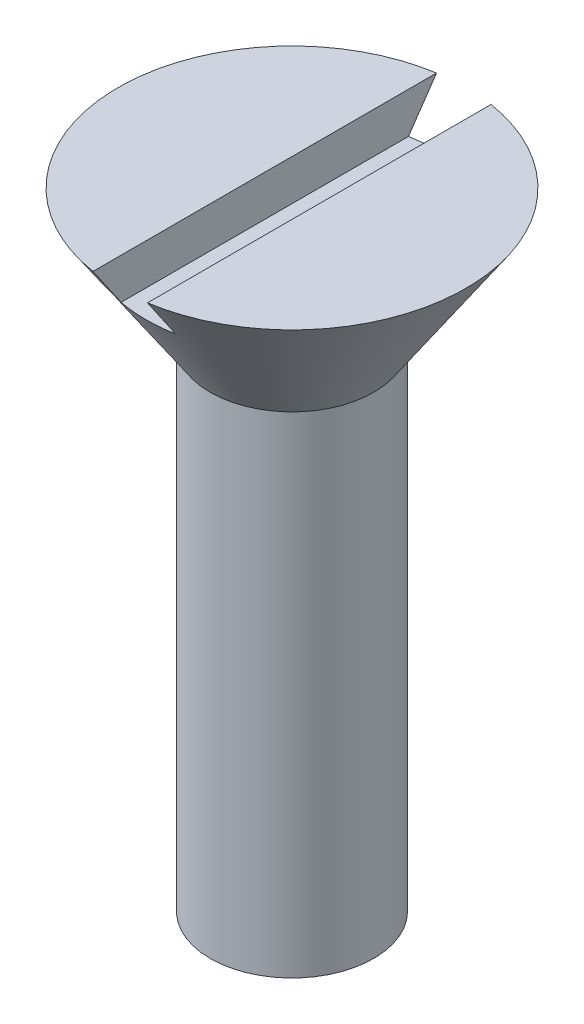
from build123d import *

# Parameters (mm, degrees)
CUT_EXTRUDE1_DEPTH      = 27.328896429
CUT_EXTRUDE1_DEPTH_BACK = 27.328896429
SKETCH2_W               = 2
SKETCH2_H               = 1.5


with BuildPart() as part:
    # Sketch1 → Revolve1 (revolve)
    with BuildSketch(Plane.XY, mode=Mode.PRIVATE) as revolve1_sk:
        Polygon((0, 0), (6.385, 0), (3, -5), (3, -23), (0, -24.732050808), align=None)
    revolve(revolve1_sk.sketch.rotate(Axis((0, 0, 0), (0, -1, 0)), 90), axis=Axis((0, 0, 0), (0, -1, 0)))

    # Sketch2 → Cut-Extrude1 (cut, two sides: drawn at the far end of the back side and taken through both)
    with BuildSketch(Plane.XY.offset(-CUT_EXTRUDE1_DEPTH_BACK)):
        with Locations((0, -0.75)):
            Rectangle(SKETCH2_W, SKETCH2_H)
    extrude(amount=CUT_EXTRUDE1_DEPTH + CUT_EXTRUDE1_DEPTH_BACK, mode=Mode.SUBTRACT)


solid = part.part
